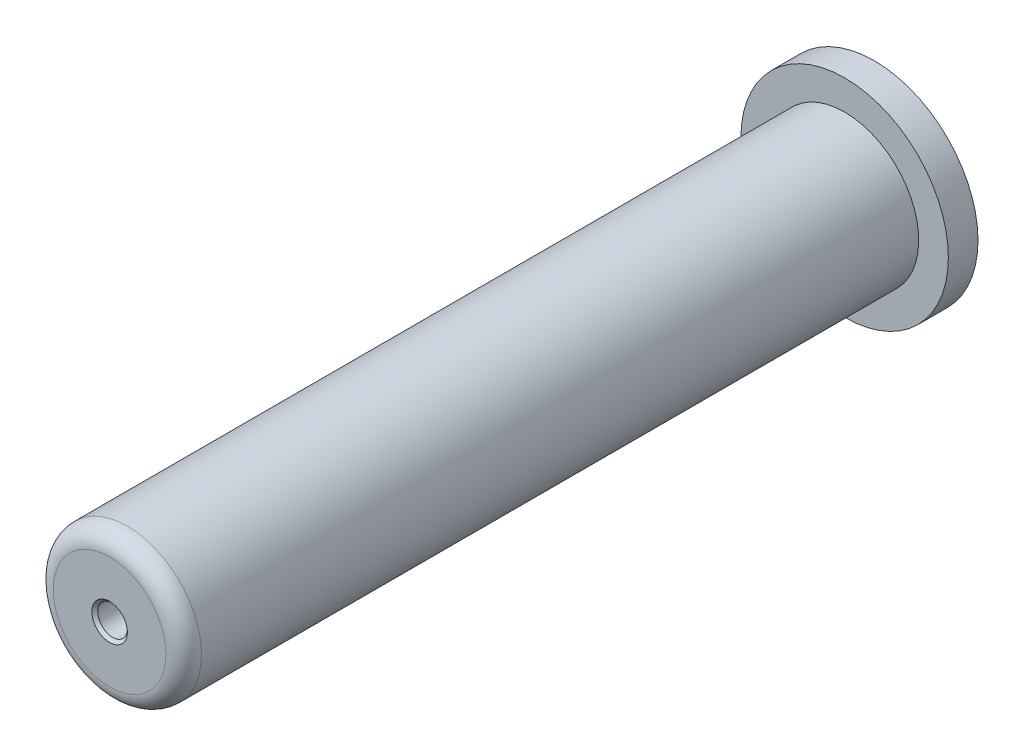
ISO-10303-21;
HEADER;
FILE_DESCRIPTION(('STEP AP214'),'2;1');
FILE_NAME('part.step','',(''),(''),'','','');
FILE_SCHEMA(('AUTOMOTIVE_DESIGN { 1 0 10303 214 1 1 1 1 }'));
ENDSEC;
DATA;
#1=APPLICATION_CONTEXT('core data for automotive mechanical design processes');
#2=APPLICATION_PROTOCOL_DEFINITION('international standard','automotive_design',2000,#1);
#3=PRODUCT_CONTEXT('',#1,'mechanical');
#4=PRODUCT('Part','Part','',(#3));
#5=PRODUCT_RELATED_PRODUCT_CATEGORY('part','',(#4));
#6=PRODUCT_DEFINITION_FORMATION('','',#4);
#7=PRODUCT_DEFINITION_CONTEXT('part definition',#1,'design');
#8=PRODUCT_DEFINITION('design','',#6,#7);
#9=PRODUCT_DEFINITION_SHAPE('','',#8);
#10=(LENGTH_UNIT() NAMED_UNIT(*) SI_UNIT(.MILLI.,.METRE.));
#11=(NAMED_UNIT(*) PLANE_ANGLE_UNIT() SI_UNIT($,.RADIAN.));
#12=(NAMED_UNIT(*) SI_UNIT($,.STERADIAN.) SOLID_ANGLE_UNIT());
#13=UNCERTAINTY_MEASURE_WITH_UNIT(LENGTH_MEASURE(1.E-05),#10,'distance_accuracy_value','');
#14=(GEOMETRIC_REPRESENTATION_CONTEXT(3) GLOBAL_UNCERTAINTY_ASSIGNED_CONTEXT((#13)) GLOBAL_UNIT_ASSIGNED_CONTEXT((#10,
#11,#12)) REPRESENTATION_CONTEXT('',''));
#15=CARTESIAN_POINT('',(0.,0.,0.));
#16=DIRECTION('',(0.,0.,1.));
#17=DIRECTION('',(1.,0.,0.));
#18=AXIS2_PLACEMENT_3D('',#15,#16,#17);
#19=CARTESIAN_POINT('',(0.,0.,0.));
#20=DIRECTION('',(0.,0.,-1.));
#21=DIRECTION('',(0.,1.,0.));
#22=AXIS2_PLACEMENT_3D('',#19,#20,#21);
#23=PLANE('',#22);
#24=CARTESIAN_POINT('',(0.,0.,0.));
#25=DIRECTION('',(0.,0.,-1.));
#26=DIRECTION('',(0.,1.,0.));
#27=AXIS2_PLACEMENT_3D('',#24,#25,#26);
#28=CIRCLE('',#27,17.5);
#29=CARTESIAN_POINT('',(0.,17.5,0.));
#30=VERTEX_POINT('',#29);
#31=EDGE_CURVE('E11',#30,#30,#28,.T.);
#32=ORIENTED_EDGE('',*,*,#31,.T.);
#33=EDGE_LOOP('',(#32));
#34=FACE_BOUND('',#33,.T.);
#35=ADVANCED_FACE('F34',(#34),#23,.T.);
#36=CARTESIAN_POINT('',(0.,0.,0.));
#37=DIRECTION('',(0.,0.,-1.));
#38=DIRECTION('',(0.,1.,0.));
#39=AXIS2_PLACEMENT_3D('',#36,#37,#38);
#40=CYLINDRICAL_SURFACE('',#39,17.5);
#41=CARTESIAN_POINT('',(0.,0.,5.));
#42=DIRECTION('',(0.,0.,-1.));
#43=DIRECTION('',(0.,1.,0.));
#44=AXIS2_PLACEMENT_3D('',#41,#42,#43);
#45=CIRCLE('',#44,17.5);
#46=CARTESIAN_POINT('',(0.,17.5,5.));
#47=VERTEX_POINT('',#46);
#48=EDGE_CURVE('E40',#47,#47,#45,.T.);
#49=ORIENTED_EDGE('',*,*,#48,.T.);
#50=EDGE_LOOP('',(#49));
#51=FACE_BOUND('',#50,.T.);
#52=ORIENTED_EDGE('',*,*,#31,.F.);
#53=EDGE_LOOP('',(#52));
#54=FACE_BOUND('',#53,.T.);
#55=ADVANCED_FACE('F71',(#51,#54),#40,.T.);
#56=CARTESIAN_POINT('',(0.,17.5,5.));
#57=DIRECTION('',(0.,0.,1.));
#58=DIRECTION('',(0.,-1.,0.));
#59=AXIS2_PLACEMENT_3D('',#56,#57,#58);
#60=PLANE('',#59);
#61=CARTESIAN_POINT('',(0.,0.,5.));
#62=DIRECTION('',(0.,0.,-1.));
#63=DIRECTION('',(0.,1.,0.));
#64=AXIS2_PLACEMENT_3D('',#61,#62,#63);
#65=CIRCLE('',#64,12.5);
#66=CARTESIAN_POINT('',(0.,12.5,5.));
#67=VERTEX_POINT('',#66);
#68=EDGE_CURVE('E66',#67,#67,#65,.T.);
#69=ORIENTED_EDGE('',*,*,#68,.T.);
#70=EDGE_LOOP('',(#69));
#71=FACE_BOUND('',#70,.T.);
#72=ORIENTED_EDGE('',*,*,#48,.F.);
#73=EDGE_LOOP('',(#72));
#74=FACE_BOUND('',#73,.T.);
#75=ADVANCED_FACE('F74',(#71,#74),#60,.T.);
#76=CARTESIAN_POINT('',(0.,0.,0.));
#77=DIRECTION('',(0.,0.,-1.));
#78=DIRECTION('',(0.,1.,0.));
#79=AXIS2_PLACEMENT_3D('',#76,#77,#78);
#80=CYLINDRICAL_SURFACE('',#79,12.5);
#81=CARTESIAN_POINT('',(0.,0.,126.));
#82=DIRECTION('',(0.,0.,-1.));
#83=DIRECTION('',(0.,1.,0.));
#84=AXIS2_PLACEMENT_3D('',#81,#82,#83);
#85=CIRCLE('',#84,12.5);
#86=CARTESIAN_POINT('',(0.,12.5,126.));
#87=VERTEX_POINT('',#86);
#88=EDGE_CURVE('E63',#87,#87,#85,.T.);
#89=ORIENTED_EDGE('',*,*,#88,.T.);
#90=EDGE_LOOP('',(#89));
#91=FACE_BOUND('',#90,.T.);
#92=ORIENTED_EDGE('',*,*,#68,.F.);
#93=EDGE_LOOP('',(#92));
#94=FACE_BOUND('',#93,.T.);
#95=ADVANCED_FACE('F76',(#91,#94),#80,.T.);
#96=CARTESIAN_POINT('',(0.,0.,126.));
#97=DIRECTION('',(0.,0.,-1.));
#98=DIRECTION('',(0.,1.,0.));
#99=AXIS2_PLACEMENT_3D('',#96,#97,#98);
#100=TOROIDAL_SURFACE('',#99,9.5,3.);
#101=CARTESIAN_POINT('',(0.,0.,129.));
#102=DIRECTION('',(0.,0.,-1.));
#103=DIRECTION('',(0.,1.,0.));
#104=AXIS2_PLACEMENT_3D('',#101,#102,#103);
#105=CIRCLE('',#104,9.5);
#106=CARTESIAN_POINT('',(0.,9.49999999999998,129.));
#107=VERTEX_POINT('',#106);
#108=EDGE_CURVE('E60',#107,#107,#105,.T.);
#109=ORIENTED_EDGE('',*,*,#108,.T.);
#110=EDGE_LOOP('',(#109));
#111=FACE_BOUND('',#110,.T.);
#112=ORIENTED_EDGE('',*,*,#88,.F.);
#113=EDGE_LOOP('',(#112));
#114=FACE_BOUND('',#113,.T.);
#115=ADVANCED_FACE('F83',(#111,#114),#100,.T.);
#116=CARTESIAN_POINT('',(0.,9.49999999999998,129.));
#117=DIRECTION('',(0.,0.,1.));
#118=DIRECTION('',(0.,-1.,0.));
#119=AXIS2_PLACEMENT_3D('',#116,#117,#118);
#120=PLANE('',#119);
#121=CARTESIAN_POINT('',(0.,0.,129.));
#122=DIRECTION('',(0.,0.,-1.));
#123=DIRECTION('',(0.,1.,0.));
#124=AXIS2_PLACEMENT_3D('',#121,#122,#123);
#125=CIRCLE('',#124,3.);
#126=CARTESIAN_POINT('',(0.,2.99999999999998,129.));
#127=VERTEX_POINT('',#126);
#128=EDGE_CURVE('E55',#127,#127,#125,.T.);
#129=ORIENTED_EDGE('',*,*,#128,.T.);
#130=EDGE_LOOP('',(#129));
#131=FACE_BOUND('',#130,.T.);
#132=ORIENTED_EDGE('',*,*,#108,.F.);
#133=EDGE_LOOP('',(#132));
#134=FACE_BOUND('',#133,.T.);
#135=ADVANCED_FACE('F115',(#131,#134),#120,.T.);
#136=CARTESIAN_POINT('',(0.,0.,129.));
#137=DIRECTION('',(0.,0.,1.));
#138=DIRECTION('',(0.,-1.,0.));
#139=AXIS2_PLACEMENT_3D('',#136,#137,#138);
#140=CONICAL_SURFACE('',#139,3.,0.785398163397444);
#141=CARTESIAN_POINT('',(0.,0.,128.5));
#142=DIRECTION('',(0.,0.,-1.));
#143=DIRECTION('',(0.,1.,0.));
#144=AXIS2_PLACEMENT_3D('',#141,#142,#143);
#145=CIRCLE('',#144,2.5);
#146=CARTESIAN_POINT('',(0.,2.49999999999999,128.5));
#147=VERTEX_POINT('',#146);
#148=EDGE_CURVE('E52',#147,#147,#145,.T.);
#149=ORIENTED_EDGE('',*,*,#148,.T.);
#150=EDGE_LOOP('',(#149));
#151=FACE_BOUND('',#150,.T.);
#152=ORIENTED_EDGE('',*,*,#128,.F.);
#153=EDGE_LOOP('',(#152));
#154=FACE_BOUND('',#153,.T.);
#155=ADVANCED_FACE('F125',(#151,#154),#140,.F.);
#156=CARTESIAN_POINT('',(0.,0.,0.));
#157=DIRECTION('',(0.,0.,-1.));
#158=DIRECTION('',(0.,1.,0.));
#159=AXIS2_PLACEMENT_3D('',#156,#157,#158);
#160=CYLINDRICAL_SURFACE('',#159,2.5);
#161=CARTESIAN_POINT('',(0.,0.,123.));
#162=DIRECTION('',(0.,0.,-1.));
#163=DIRECTION('',(0.,1.,0.));
#164=AXIS2_PLACEMENT_3D('',#161,#162,#163);
#165=CIRCLE('',#164,2.5);
#166=CARTESIAN_POINT('',(0.,2.49999999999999,123.));
#167=VERTEX_POINT('',#166);
#168=EDGE_CURVE('E50',#167,#167,#165,.T.);
#169=ORIENTED_EDGE('',*,*,#168,.T.);
#170=EDGE_LOOP('',(#169));
#171=FACE_BOUND('',#170,.T.);
#172=ORIENTED_EDGE('',*,*,#148,.F.);
#173=EDGE_LOOP('',(#172));
#174=FACE_BOUND('',#173,.T.);
#175=ADVANCED_FACE('F46',(#171,#174),#160,.F.);
#176=CARTESIAN_POINT('',(0.,0.,123.));
#177=DIRECTION('',(0.,0.,1.));
#178=DIRECTION('',(0.,-1.,0.));
#179=AXIS2_PLACEMENT_3D('',#176,#177,#178);
#180=CONICAL_SURFACE('',#179,2.5,0.959931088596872);
#181=CARTESIAN_POINT('',(0.,0.,121.249481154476));
#182=VERTEX_POINT('',#181);
#183=VERTEX_LOOP('',#182);
#184=FACE_BOUND('',#183,.T.);
#185=ORIENTED_EDGE('',*,*,#168,.F.);
#186=EDGE_LOOP('',(#185));
#187=FACE_BOUND('',#186,.T.);
#188=ADVANCED_FACE('F43',(#184,#187),#180,.F.);
#189=CLOSED_SHELL('',(#35,#55,#75,#95,#115,#135,#155,#175,#188));
#190=MANIFOLD_SOLID_BREP('B2',#189);
#191=ADVANCED_BREP_SHAPE_REPRESENTATION('',(#18,#190),#14);
#192=SHAPE_DEFINITION_REPRESENTATION(#9,#191);
ENDSEC;
END-ISO-10303-21;
